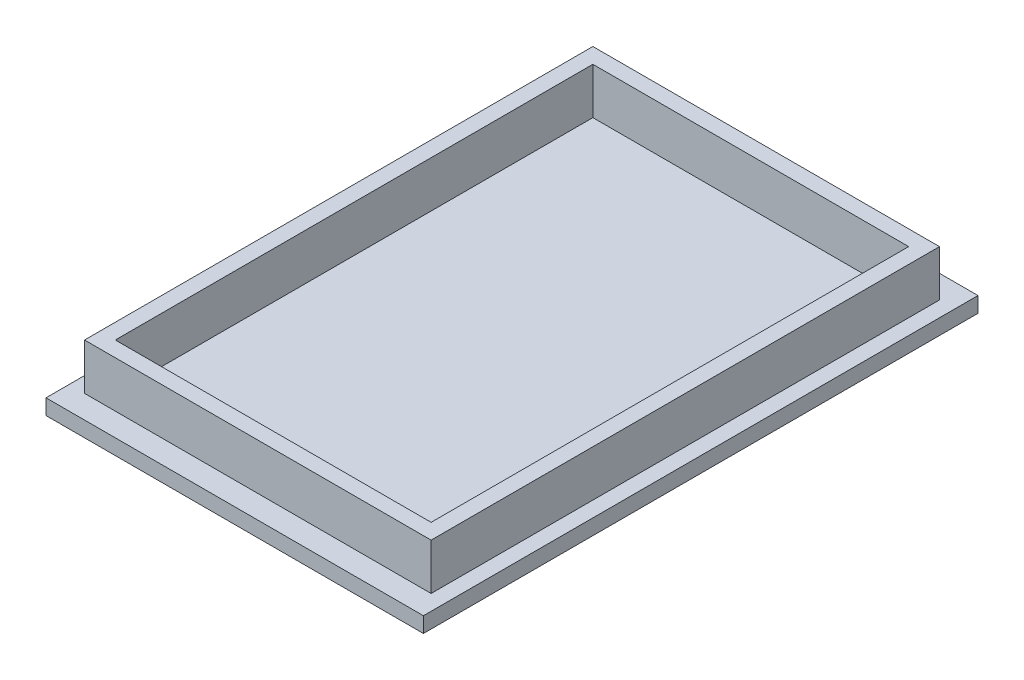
ISO-10303-21;
HEADER;
FILE_DESCRIPTION(('STEP AP214'),'2;1');
FILE_NAME('part.step','',(''),(''),'','','');
FILE_SCHEMA(('AUTOMOTIVE_DESIGN { 1 0 10303 214 1 1 1 1 }'));
ENDSEC;
DATA;
#1=APPLICATION_CONTEXT('core data for automotive mechanical design processes');
#2=APPLICATION_PROTOCOL_DEFINITION('international standard','automotive_design',2000,#1);
#3=PRODUCT_CONTEXT('',#1,'mechanical');
#4=PRODUCT('Part','Part','',(#3));
#5=PRODUCT_RELATED_PRODUCT_CATEGORY('part','',(#4));
#6=PRODUCT_DEFINITION_FORMATION('','',#4);
#7=PRODUCT_DEFINITION_CONTEXT('part definition',#1,'design');
#8=PRODUCT_DEFINITION('design','',#6,#7);
#9=PRODUCT_DEFINITION_SHAPE('','',#8);
#10=(LENGTH_UNIT() NAMED_UNIT(*) SI_UNIT(.MILLI.,.METRE.));
#11=(NAMED_UNIT(*) PLANE_ANGLE_UNIT() SI_UNIT($,.RADIAN.));
#12=(NAMED_UNIT(*) SI_UNIT($,.STERADIAN.) SOLID_ANGLE_UNIT());
#13=UNCERTAINTY_MEASURE_WITH_UNIT(LENGTH_MEASURE(1.E-05),#10,'distance_accuracy_value','');
#14=(GEOMETRIC_REPRESENTATION_CONTEXT(3) GLOBAL_UNCERTAINTY_ASSIGNED_CONTEXT((#13)) GLOBAL_UNIT_ASSIGNED_CONTEXT((#10,
#11,#12)) REPRESENTATION_CONTEXT('',''));
#15=CARTESIAN_POINT('',(0.,0.,0.));
#16=DIRECTION('',(0.,0.,1.));
#17=DIRECTION('',(1.,0.,0.));
#18=AXIS2_PLACEMENT_3D('',#15,#16,#17);
#19=CARTESIAN_POINT('',(0.,-2.,-69.));
#20=DIRECTION('',(0.,0.,-1.));
#21=DIRECTION('',(-1.,0.,0.));
#22=AXIS2_PLACEMENT_3D('',#19,#20,#21);
#23=PLANE('',#22);
#24=DIRECTION('',(-1.,0.,0.));
#25=VECTOR('',#24,1.);
#26=CARTESIAN_POINT('',(0.,0.,-69.));
#27=LINE('',#26,#25);
#28=CARTESIAN_POINT('',(2.,0.,-69.));
#29=VERTEX_POINT('',#28);
#30=CARTESIAN_POINT('',(-47.,0.,-69.));
#31=VERTEX_POINT('',#30);
#32=EDGE_CURVE('E214',#29,#31,#27,.T.);
#33=ORIENTED_EDGE('',*,*,#32,.F.);
#34=DIRECTION('',(0.,1.,0.));
#35=VECTOR('',#34,1.);
#36=CARTESIAN_POINT('',(2.,-2.,-69.));
#37=LINE('',#36,#35);
#38=CARTESIAN_POINT('',(2.,-2.,-69.));
#39=VERTEX_POINT('',#38);
#40=EDGE_CURVE('E11',#39,#29,#37,.T.);
#41=ORIENTED_EDGE('',*,*,#40,.F.);
#42=DIRECTION('',(-1.,0.,0.));
#43=VECTOR('',#42,1.);
#44=CARTESIAN_POINT('',(0.,-2.,-69.));
#45=LINE('',#44,#43);
#46=CARTESIAN_POINT('',(-47.,-2.,-69.));
#47=VERTEX_POINT('',#46);
#48=EDGE_CURVE('E223',#39,#47,#45,.T.);
#49=ORIENTED_EDGE('',*,*,#48,.T.);
#50=DIRECTION('',(0.,1.,0.));
#51=VECTOR('',#50,1.);
#52=CARTESIAN_POINT('',(-47.,-2.,-69.));
#53=LINE('',#52,#51);
#54=EDGE_CURVE('E42',#47,#31,#53,.T.);
#55=ORIENTED_EDGE('',*,*,#54,.T.);
#56=EDGE_LOOP('',(#33,#41,#49,#55));
#57=FACE_BOUND('',#56,.T.);
#58=ADVANCED_FACE('F39',(#57),#23,.T.);
#59=CARTESIAN_POINT('',(2.,-2.,0.));
#60=DIRECTION('',(1.,0.,0.));
#61=DIRECTION('',(0.,0.,-1.));
#62=AXIS2_PLACEMENT_3D('',#59,#60,#61);
#63=PLANE('',#62);
#64=DIRECTION('',(0.,0.,-1.));
#65=VECTOR('',#64,1.);
#66=CARTESIAN_POINT('',(2.,0.,0.));
#67=LINE('',#66,#65);
#68=CARTESIAN_POINT('',(2.,0.,3.));
#69=VERTEX_POINT('',#68);
#70=EDGE_CURVE('E228',#69,#29,#67,.T.);
#71=ORIENTED_EDGE('',*,*,#70,.F.);
#72=DIRECTION('',(0.,1.,0.));
#73=VECTOR('',#72,1.);
#74=CARTESIAN_POINT('',(2.,-2.,3.));
#75=LINE('',#74,#73);
#76=CARTESIAN_POINT('',(2.,-2.,3.));
#77=VERTEX_POINT('',#76);
#78=EDGE_CURVE('E48',#77,#69,#75,.T.);
#79=ORIENTED_EDGE('',*,*,#78,.F.);
#80=DIRECTION('',(0.,0.,-1.));
#81=VECTOR('',#80,1.);
#82=CARTESIAN_POINT('',(2.,-2.,0.));
#83=LINE('',#82,#81);
#84=EDGE_CURVE('E236',#77,#39,#83,.T.);
#85=ORIENTED_EDGE('',*,*,#84,.T.);
#86=ORIENTED_EDGE('',*,*,#40,.T.);
#87=EDGE_LOOP('',(#71,#79,#85,#86));
#88=FACE_BOUND('',#87,.T.);
#89=ADVANCED_FACE('F270',(#88),#63,.T.);
#90=CARTESIAN_POINT('',(0.,-2.,3.));
#91=DIRECTION('',(0.,0.,1.));
#92=DIRECTION('',(1.,0.,0.));
#93=AXIS2_PLACEMENT_3D('',#90,#91,#92);
#94=PLANE('',#93);
#95=DIRECTION('',(1.,0.,0.));
#96=VECTOR('',#95,1.);
#97=CARTESIAN_POINT('',(0.,0.,3.));
#98=LINE('',#97,#96);
#99=CARTESIAN_POINT('',(-47.,0.,3.));
#100=VERTEX_POINT('',#99);
#101=EDGE_CURVE('E247',#100,#69,#98,.T.);
#102=ORIENTED_EDGE('',*,*,#101,.F.);
#103=DIRECTION('',(0.,1.,0.));
#104=VECTOR('',#103,1.);
#105=CARTESIAN_POINT('',(-47.,-2.,3.));
#106=LINE('',#105,#104);
#107=CARTESIAN_POINT('',(-47.,-2.,3.));
#108=VERTEX_POINT('',#107);
#109=EDGE_CURVE('E255',#108,#100,#106,.T.);
#110=ORIENTED_EDGE('',*,*,#109,.F.);
#111=DIRECTION('',(1.,0.,0.));
#112=VECTOR('',#111,1.);
#113=CARTESIAN_POINT('',(0.,-2.,3.));
#114=LINE('',#113,#112);
#115=EDGE_CURVE('E232',#108,#77,#114,.T.);
#116=ORIENTED_EDGE('',*,*,#115,.T.);
#117=ORIENTED_EDGE('',*,*,#78,.T.);
#118=EDGE_LOOP('',(#102,#110,#116,#117));
#119=FACE_BOUND('',#118,.T.);
#120=ADVANCED_FACE('F276',(#119),#94,.T.);
#121=CARTESIAN_POINT('',(-47.,-2.,0.));
#122=DIRECTION('',(-1.,0.,0.));
#123=DIRECTION('',(0.,0.,1.));
#124=AXIS2_PLACEMENT_3D('',#121,#122,#123);
#125=PLANE('',#124);
#126=DIRECTION('',(0.,0.,1.));
#127=VECTOR('',#126,1.);
#128=CARTESIAN_POINT('',(-47.,0.,0.));
#129=LINE('',#128,#127);
#130=EDGE_CURVE('E243',#31,#100,#129,.T.);
#131=ORIENTED_EDGE('',*,*,#130,.F.);
#132=ORIENTED_EDGE('',*,*,#54,.F.);
#133=DIRECTION('',(0.,0.,1.));
#134=VECTOR('',#133,1.);
#135=CARTESIAN_POINT('',(-47.,-2.,0.));
#136=LINE('',#135,#134);
#137=EDGE_CURVE('E227',#47,#108,#136,.T.);
#138=ORIENTED_EDGE('',*,*,#137,.T.);
#139=ORIENTED_EDGE('',*,*,#109,.T.);
#140=EDGE_LOOP('',(#131,#132,#138,#139));
#141=FACE_BOUND('',#140,.T.);
#142=ADVANCED_FACE('F265',(#141),#125,.T.);
#143=CARTESIAN_POINT('',(0.,-2.,0.));
#144=DIRECTION('',(0.,1.,0.));
#145=DIRECTION('',(0.,0.,1.));
#146=AXIS2_PLACEMENT_3D('',#143,#144,#145);
#147=PLANE('',#146);
#148=ORIENTED_EDGE('',*,*,#48,.F.);
#149=ORIENTED_EDGE('',*,*,#84,.F.);
#150=ORIENTED_EDGE('',*,*,#115,.F.);
#151=ORIENTED_EDGE('',*,*,#137,.F.);
#152=EDGE_LOOP('',(#148,#149,#150,#151));
#153=FACE_BOUND('',#152,.T.);
#154=ADVANCED_FACE('F273',(#153),#147,.F.);
#155=CARTESIAN_POINT('',(0.,0.,0.));
#156=DIRECTION('',(0.,1.,0.));
#157=DIRECTION('',(0.,0.,1.));
#158=AXIS2_PLACEMENT_3D('',#155,#156,#157);
#159=PLANE('',#158);
#160=DIRECTION('',(0.,0.,1.));
#161=VECTOR('',#160,1.);
#162=CARTESIAN_POINT('',(0.,0.,0.));
#163=LINE('',#162,#161);
#164=CARTESIAN_POINT('',(0.,0.,-66.));
#165=VERTEX_POINT('',#164);
#166=CARTESIAN_POINT('',(0.,0.,0.));
#167=VERTEX_POINT('',#166);
#168=EDGE_CURVE('E188',#165,#167,#163,.T.);
#169=ORIENTED_EDGE('',*,*,#168,.T.);
#170=DIRECTION('',(-1.,0.,0.));
#171=VECTOR('',#170,1.);
#172=CARTESIAN_POINT('',(0.,0.,0.));
#173=LINE('',#172,#171);
#174=CARTESIAN_POINT('',(-45.,0.,0.));
#175=VERTEX_POINT('',#174);
#176=EDGE_CURVE('E151',#167,#175,#173,.T.);
#177=ORIENTED_EDGE('',*,*,#176,.T.);
#178=DIRECTION('',(0.,0.,-1.));
#179=VECTOR('',#178,1.);
#180=CARTESIAN_POINT('',(-45.,0.,0.));
#181=LINE('',#180,#179);
#182=CARTESIAN_POINT('',(-45.,0.,-66.));
#183=VERTEX_POINT('',#182);
#184=EDGE_CURVE('E194',#175,#183,#181,.T.);
#185=ORIENTED_EDGE('',*,*,#184,.T.);
#186=DIRECTION('',(1.,0.,0.));
#187=VECTOR('',#186,1.);
#188=CARTESIAN_POINT('',(0.,0.,-66.));
#189=LINE('',#188,#187);
#190=EDGE_CURVE('E191',#183,#165,#189,.T.);
#191=ORIENTED_EDGE('',*,*,#190,.T.);
#192=EDGE_LOOP('',(#169,#177,#185,#191));
#193=FACE_BOUND('',#192,.T.);
#194=ORIENTED_EDGE('',*,*,#32,.T.);
#195=ORIENTED_EDGE('',*,*,#130,.T.);
#196=ORIENTED_EDGE('',*,*,#101,.T.);
#197=ORIENTED_EDGE('',*,*,#70,.T.);
#198=EDGE_LOOP('',(#194,#195,#196,#197));
#199=FACE_BOUND('',#198,.T.);
#200=ADVANCED_FACE('F267',(#193,#199),#159,.T.);
#201=CARTESIAN_POINT('',(0.,6.,0.));
#202=DIRECTION('',(1.,0.,0.));
#203=DIRECTION('',(0.,0.,-1.));
#204=AXIS2_PLACEMENT_3D('',#201,#202,#203);
#205=PLANE('',#204);
#206=ORIENTED_EDGE('',*,*,#168,.F.);
#207=DIRECTION('',(0.,-1.,0.));
#208=VECTOR('',#207,1.);
#209=CARTESIAN_POINT('',(0.,6.,-66.));
#210=LINE('',#209,#208);
#211=CARTESIAN_POINT('',(0.,6.,-66.));
#212=VERTEX_POINT('',#211);
#213=EDGE_CURVE('E210',#212,#165,#210,.T.);
#214=ORIENTED_EDGE('',*,*,#213,.F.);
#215=DIRECTION('',(0.,0.,1.));
#216=VECTOR('',#215,1.);
#217=CARTESIAN_POINT('',(0.,6.,0.));
#218=LINE('',#217,#216);
#219=CARTESIAN_POINT('',(0.,6.,0.));
#220=VERTEX_POINT('',#219);
#221=EDGE_CURVE('E162',#212,#220,#218,.T.);
#222=ORIENTED_EDGE('',*,*,#221,.T.);
#223=DIRECTION('',(0.,-1.,0.));
#224=VECTOR('',#223,1.);
#225=CARTESIAN_POINT('',(0.,6.,0.));
#226=LINE('',#225,#224);
#227=EDGE_CURVE('E138',#220,#167,#226,.T.);
#228=ORIENTED_EDGE('',*,*,#227,.T.);
#229=EDGE_LOOP('',(#206,#214,#222,#228));
#230=FACE_BOUND('',#229,.T.);
#231=ADVANCED_FACE('F324',(#230),#205,.T.);
#232=CARTESIAN_POINT('',(0.,6.,-66.));
#233=DIRECTION('',(0.,0.,-1.));
#234=DIRECTION('',(-1.,0.,0.));
#235=AXIS2_PLACEMENT_3D('',#232,#233,#234);
#236=PLANE('',#235);
#237=ORIENTED_EDGE('',*,*,#190,.F.);
#238=DIRECTION('',(0.,-1.,0.));
#239=VECTOR('',#238,1.);
#240=CARTESIAN_POINT('',(-45.,6.,-66.));
#241=LINE('',#240,#239);
#242=CARTESIAN_POINT('',(-45.,6.,-66.));
#243=VERTEX_POINT('',#242);
#244=EDGE_CURVE('E206',#243,#183,#241,.T.);
#245=ORIENTED_EDGE('',*,*,#244,.F.);
#246=DIRECTION('',(1.,0.,0.));
#247=VECTOR('',#246,1.);
#248=CARTESIAN_POINT('',(0.,6.,-66.));
#249=LINE('',#248,#247);
#250=EDGE_CURVE('E166',#243,#212,#249,.T.);
#251=ORIENTED_EDGE('',*,*,#250,.T.);
#252=ORIENTED_EDGE('',*,*,#213,.T.);
#253=EDGE_LOOP('',(#237,#245,#251,#252));
#254=FACE_BOUND('',#253,.T.);
#255=ADVANCED_FACE('F337',(#254),#236,.T.);
#256=CARTESIAN_POINT('',(-45.,6.,0.));
#257=DIRECTION('',(-1.,0.,0.));
#258=DIRECTION('',(0.,0.,1.));
#259=AXIS2_PLACEMENT_3D('',#256,#257,#258);
#260=PLANE('',#259);
#261=ORIENTED_EDGE('',*,*,#184,.F.);
#262=DIRECTION('',(0.,-1.,0.));
#263=VECTOR('',#262,1.);
#264=CARTESIAN_POINT('',(-45.,6.,0.));
#265=LINE('',#264,#263);
#266=CARTESIAN_POINT('',(-45.,6.,0.));
#267=VERTEX_POINT('',#266);
#268=EDGE_CURVE('E202',#267,#175,#265,.T.);
#269=ORIENTED_EDGE('',*,*,#268,.F.);
#270=DIRECTION('',(0.,0.,-1.));
#271=VECTOR('',#270,1.);
#272=CARTESIAN_POINT('',(-45.,6.,0.));
#273=LINE('',#272,#271);
#274=EDGE_CURVE('E170',#267,#243,#273,.T.);
#275=ORIENTED_EDGE('',*,*,#274,.T.);
#276=ORIENTED_EDGE('',*,*,#244,.T.);
#277=EDGE_LOOP('',(#261,#269,#275,#276));
#278=FACE_BOUND('',#277,.T.);
#279=ADVANCED_FACE('F348',(#278),#260,.T.);
#280=CARTESIAN_POINT('',(0.,6.,-64.));
#281=DIRECTION('',(0.,0.,1.));
#282=DIRECTION('',(1.,0.,0.));
#283=AXIS2_PLACEMENT_3D('',#280,#281,#282);
#284=PLANE('',#283);
#285=DIRECTION('',(-1.,0.,0.));
#286=VECTOR('',#285,1.);
#287=CARTESIAN_POINT('',(0.,0.,-64.));
#288=LINE('',#287,#286);
#289=CARTESIAN_POINT('',(-2.,0.,-64.));
#290=VERTEX_POINT('',#289);
#291=CARTESIAN_POINT('',(-43.,0.,-64.));
#292=VERTEX_POINT('',#291);
#293=EDGE_CURVE('E134',#290,#292,#288,.T.);
#294=ORIENTED_EDGE('',*,*,#293,.F.);
#295=DIRECTION('',(0.,-1.,0.));
#296=VECTOR('',#295,1.);
#297=CARTESIAN_POINT('',(-2.,6.,-64.));
#298=LINE('',#297,#296);
#299=CARTESIAN_POINT('',(-2.,6.,-64.));
#300=VERTEX_POINT('',#299);
#301=EDGE_CURVE('E128',#300,#290,#298,.T.);
#302=ORIENTED_EDGE('',*,*,#301,.F.);
#303=DIRECTION('',(-1.,0.,0.));
#304=VECTOR('',#303,1.);
#305=CARTESIAN_POINT('',(0.,6.,-64.));
#306=LINE('',#305,#304);
#307=CARTESIAN_POINT('',(-43.,6.,-64.));
#308=VERTEX_POINT('',#307);
#309=EDGE_CURVE('E132',#300,#308,#306,.T.);
#310=ORIENTED_EDGE('',*,*,#309,.T.);
#311=DIRECTION('',(0.,-1.,0.));
#312=VECTOR('',#311,1.);
#313=CARTESIAN_POINT('',(-43.,6.,-64.));
#314=LINE('',#313,#312);
#315=EDGE_CURVE('E178',#308,#292,#314,.T.);
#316=ORIENTED_EDGE('',*,*,#315,.T.);
#317=EDGE_LOOP('',(#294,#302,#310,#316));
#318=FACE_BOUND('',#317,.T.);
#319=ADVANCED_FACE('F130',(#318),#284,.T.);
#320=CARTESIAN_POINT('',(-2.,6.,0.));
#321=DIRECTION('',(-1.,0.,0.));
#322=DIRECTION('',(0.,0.,1.));
#323=AXIS2_PLACEMENT_3D('',#320,#321,#322);
#324=PLANE('',#323);
#325=DIRECTION('',(0.,0.,-1.));
#326=VECTOR('',#325,1.);
#327=CARTESIAN_POINT('',(-2.,0.,0.));
#328=LINE('',#327,#326);
#329=CARTESIAN_POINT('',(-2.,0.,-2.));
#330=VERTEX_POINT('',#329);
#331=EDGE_CURVE('E56',#330,#290,#328,.T.);
#332=ORIENTED_EDGE('',*,*,#331,.F.);
#333=DIRECTION('',(0.,-1.,0.));
#334=VECTOR('',#333,1.);
#335=CARTESIAN_POINT('',(-2.,6.,-2.));
#336=LINE('',#335,#334);
#337=CARTESIAN_POINT('',(-2.,6.,-2.));
#338=VERTEX_POINT('',#337);
#339=EDGE_CURVE('E139',#338,#330,#336,.T.);
#340=ORIENTED_EDGE('',*,*,#339,.F.);
#341=DIRECTION('',(0.,0.,-1.));
#342=VECTOR('',#341,1.);
#343=CARTESIAN_POINT('',(-2.,6.,0.));
#344=LINE('',#343,#342);
#345=EDGE_CURVE('E146',#338,#300,#344,.T.);
#346=ORIENTED_EDGE('',*,*,#345,.T.);
#347=ORIENTED_EDGE('',*,*,#301,.T.);
#348=EDGE_LOOP('',(#332,#340,#346,#347));
#349=FACE_BOUND('',#348,.T.);
#350=ADVANCED_FACE('F153',(#349),#324,.T.);
#351=CARTESIAN_POINT('',(0.,6.,-2.));
#352=DIRECTION('',(0.,0.,-1.));
#353=DIRECTION('',(-1.,0.,0.));
#354=AXIS2_PLACEMENT_3D('',#351,#352,#353);
#355=PLANE('',#354);
#356=DIRECTION('',(1.,0.,0.));
#357=VECTOR('',#356,1.);
#358=CARTESIAN_POINT('',(0.,0.,-2.));
#359=LINE('',#358,#357);
#360=CARTESIAN_POINT('',(-43.,0.,-2.));
#361=VERTEX_POINT('',#360);
#362=EDGE_CURVE('E61',#361,#330,#359,.T.);
#363=ORIENTED_EDGE('',*,*,#362,.F.);
#364=DIRECTION('',(0.,-1.,0.));
#365=VECTOR('',#364,1.);
#366=CARTESIAN_POINT('',(-43.,6.,-2.));
#367=LINE('',#366,#365);
#368=CARTESIAN_POINT('',(-43.,6.,-2.));
#369=VERTEX_POINT('',#368);
#370=EDGE_CURVE('E217',#369,#361,#367,.T.);
#371=ORIENTED_EDGE('',*,*,#370,.F.);
#372=DIRECTION('',(1.,0.,0.));
#373=VECTOR('',#372,1.);
#374=CARTESIAN_POINT('',(0.,6.,-2.));
#375=LINE('',#374,#373);
#376=EDGE_CURVE('E155',#369,#338,#375,.T.);
#377=ORIENTED_EDGE('',*,*,#376,.T.);
#378=ORIENTED_EDGE('',*,*,#339,.T.);
#379=EDGE_LOOP('',(#363,#371,#377,#378));
#380=FACE_BOUND('',#379,.T.);
#381=ADVANCED_FACE('F376',(#380),#355,.T.);
#382=CARTESIAN_POINT('',(-43.,6.,0.));
#383=DIRECTION('',(1.,0.,0.));
#384=DIRECTION('',(0.,0.,-1.));
#385=AXIS2_PLACEMENT_3D('',#382,#383,#384);
#386=PLANE('',#385);
#387=DIRECTION('',(0.,0.,1.));
#388=VECTOR('',#387,1.);
#389=CARTESIAN_POINT('',(-43.,0.,0.));
#390=LINE('',#389,#388);
#391=EDGE_CURVE('E185',#292,#361,#390,.T.);
#392=ORIENTED_EDGE('',*,*,#391,.F.);
#393=ORIENTED_EDGE('',*,*,#315,.F.);
#394=DIRECTION('',(0.,0.,1.));
#395=VECTOR('',#394,1.);
#396=CARTESIAN_POINT('',(-43.,6.,0.));
#397=LINE('',#396,#395);
#398=EDGE_CURVE('E149',#308,#369,#397,.T.);
#399=ORIENTED_EDGE('',*,*,#398,.T.);
#400=ORIENTED_EDGE('',*,*,#370,.T.);
#401=EDGE_LOOP('',(#392,#393,#399,#400));
#402=FACE_BOUND('',#401,.T.);
#403=ADVANCED_FACE('F386',(#402),#386,.T.);
#404=CARTESIAN_POINT('',(0.,6.,0.));
#405=DIRECTION('',(0.,0.,1.));
#406=DIRECTION('',(1.,0.,0.));
#407=AXIS2_PLACEMENT_3D('',#404,#405,#406);
#408=PLANE('',#407);
#409=ORIENTED_EDGE('',*,*,#176,.F.);
#410=ORIENTED_EDGE('',*,*,#227,.F.);
#411=DIRECTION('',(-1.,0.,0.));
#412=VECTOR('',#411,1.);
#413=CARTESIAN_POINT('',(0.,6.,0.));
#414=LINE('',#413,#412);
#415=EDGE_CURVE('E174',#220,#267,#414,.T.);
#416=ORIENTED_EDGE('',*,*,#415,.T.);
#417=ORIENTED_EDGE('',*,*,#268,.T.);
#418=EDGE_LOOP('',(#409,#410,#416,#417));
#419=FACE_BOUND('',#418,.T.);
#420=ADVANCED_FACE('F397',(#419),#408,.T.);
#421=CARTESIAN_POINT('',(0.,6.,0.));
#422=DIRECTION('',(0.,1.,0.));
#423=DIRECTION('',(0.,0.,1.));
#424=AXIS2_PLACEMENT_3D('',#421,#422,#423);
#425=PLANE('',#424);
#426=ORIENTED_EDGE('',*,*,#309,.F.);
#427=ORIENTED_EDGE('',*,*,#345,.F.);
#428=ORIENTED_EDGE('',*,*,#376,.F.);
#429=ORIENTED_EDGE('',*,*,#398,.F.);
#430=EDGE_LOOP('',(#426,#427,#428,#429));
#431=FACE_BOUND('',#430,.T.);
#432=ORIENTED_EDGE('',*,*,#221,.F.);
#433=ORIENTED_EDGE('',*,*,#250,.F.);
#434=ORIENTED_EDGE('',*,*,#274,.F.);
#435=ORIENTED_EDGE('',*,*,#415,.F.);
#436=EDGE_LOOP('',(#432,#433,#434,#435));
#437=FACE_BOUND('',#436,.T.);
#438=ADVANCED_FACE('F143',(#431,#437),#425,.T.);
#439=ORIENTED_EDGE('',*,*,#293,.T.);
#440=ORIENTED_EDGE('',*,*,#391,.T.);
#441=ORIENTED_EDGE('',*,*,#362,.T.);
#442=ORIENTED_EDGE('',*,*,#331,.T.);
#443=EDGE_LOOP('',(#439,#440,#441,#442));
#444=FACE_BOUND('',#443,.T.);
#445=ADVANCED_FACE('F327',(#444),#159,.T.);
#446=CLOSED_SHELL('',(#58,#89,#120,#142,#154,#200,#231,#255,#279,#319,#350,#381,#403,#420,#438,#445));
#447=MANIFOLD_SOLID_BREP('B2',#446);
#448=ADVANCED_BREP_SHAPE_REPRESENTATION('',(#18,#447),#14);
#449=SHAPE_DEFINITION_REPRESENTATION(#9,#448);
ENDSEC;
END-ISO-10303-21;
